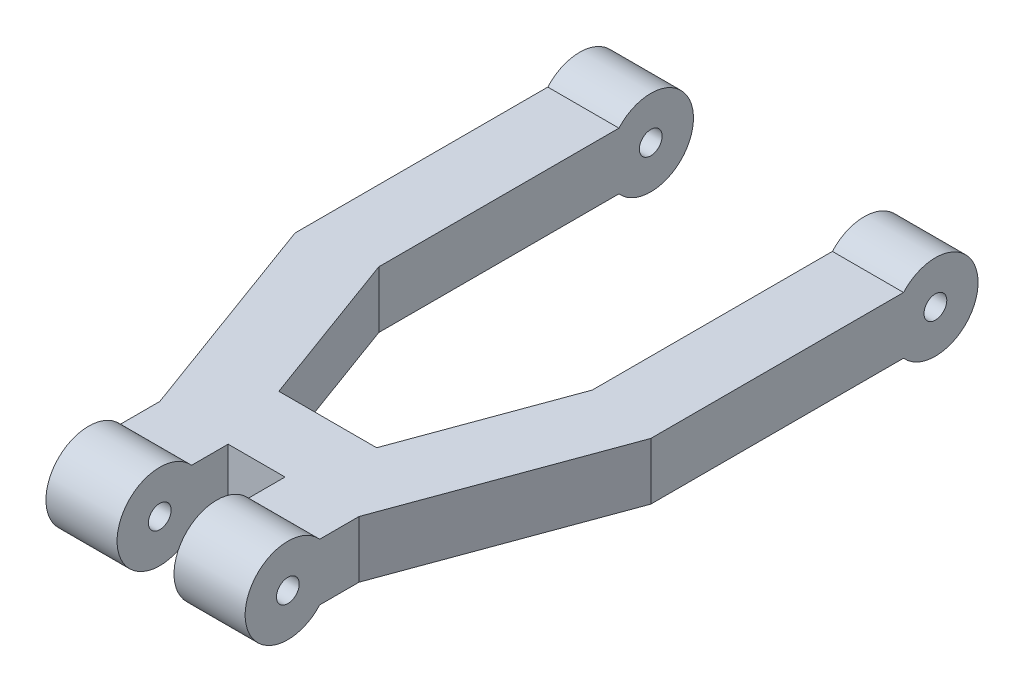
ISO-10303-21;
HEADER;
FILE_DESCRIPTION(('STEP AP214'),'2;1');
FILE_NAME('part.step','',(''),(''),'','','');
FILE_SCHEMA(('AUTOMOTIVE_DESIGN { 1 0 10303 214 1 1 1 1 }'));
ENDSEC;
DATA;
#1=APPLICATION_CONTEXT('core data for automotive mechanical design processes');
#2=APPLICATION_PROTOCOL_DEFINITION('international standard','automotive_design',2000,#1);
#3=PRODUCT_CONTEXT('',#1,'mechanical');
#4=PRODUCT('Part','Part','',(#3));
#5=PRODUCT_RELATED_PRODUCT_CATEGORY('part','',(#4));
#6=PRODUCT_DEFINITION_FORMATION('','',#4);
#7=PRODUCT_DEFINITION_CONTEXT('part definition',#1,'design');
#8=PRODUCT_DEFINITION('design','',#6,#7);
#9=PRODUCT_DEFINITION_SHAPE('','',#8);
#10=(LENGTH_UNIT() NAMED_UNIT(*) SI_UNIT(.MILLI.,.METRE.));
#11=(NAMED_UNIT(*) PLANE_ANGLE_UNIT() SI_UNIT($,.RADIAN.));
#12=(NAMED_UNIT(*) SI_UNIT($,.STERADIAN.) SOLID_ANGLE_UNIT());
#13=UNCERTAINTY_MEASURE_WITH_UNIT(LENGTH_MEASURE(1.E-05),#10,'distance_accuracy_value','');
#14=(GEOMETRIC_REPRESENTATION_CONTEXT(3) GLOBAL_UNCERTAINTY_ASSIGNED_CONTEXT((#13)) GLOBAL_UNIT_ASSIGNED_CONTEXT((#10,
#11,#12)) REPRESENTATION_CONTEXT('',''));
#15=CARTESIAN_POINT('',(0.,0.,0.));
#16=DIRECTION('',(0.,0.,1.));
#17=DIRECTION('',(1.,0.,0.));
#18=AXIS2_PLACEMENT_3D('',#15,#16,#17);
#19=CARTESIAN_POINT('',(0.,2.54,0.));
#20=DIRECTION('',(1.,0.,0.));
#21=DIRECTION('',(0.,0.,-1.));
#22=AXIS2_PLACEMENT_3D('',#19,#20,#21);
#23=CYLINDRICAL_SURFACE('',#22,3.81);
#24=CARTESIAN_POINT('',(13.335,2.54,0.));
#25=DIRECTION('',(-1.,0.,0.));
#26=DIRECTION('',(0.,0.,1.));
#27=AXIS2_PLACEMENT_3D('',#24,#25,#26);
#28=CIRCLE('',#27,3.81);
#29=CARTESIAN_POINT('',(13.335,5.08,-2.83980633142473));
#30=VERTEX_POINT('',#29);
#31=CARTESIAN_POINT('',(13.335,0.,-2.83980633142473));
#32=VERTEX_POINT('',#31);
#33=EDGE_CURVE('E273',#30,#32,#28,.F.);
#34=ORIENTED_EDGE('',*,*,#33,.F.);
#35=DIRECTION('',(1.,0.,0.));
#36=VECTOR('',#35,1.);
#37=CARTESIAN_POINT('',(0.,5.08,-2.83980633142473));
#38=LINE('',#37,#36);
#39=CARTESIAN_POINT('',(6.985,5.08,-2.83980633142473));
#40=VERTEX_POINT('',#39);
#41=EDGE_CURVE('E254',#40,#30,#38,.T.);
#42=ORIENTED_EDGE('',*,*,#41,.F.);
#43=CARTESIAN_POINT('',(6.985,2.54,0.));
#44=DIRECTION('',(1.,0.,0.));
#45=DIRECTION('',(0.,0.,-1.));
#46=AXIS2_PLACEMENT_3D('',#43,#44,#45);
#47=CIRCLE('',#46,3.81);
#48=CARTESIAN_POINT('',(6.985,0.,-2.83980633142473));
#49=VERTEX_POINT('',#48);
#50=EDGE_CURVE('E50',#49,#40,#47,.F.);
#51=ORIENTED_EDGE('',*,*,#50,.F.);
#52=DIRECTION('',(1.,0.,0.));
#53=VECTOR('',#52,1.);
#54=CARTESIAN_POINT('',(0.,0.,-2.83980633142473));
#55=LINE('',#54,#53);
#56=EDGE_CURVE('E255',#32,#49,#55,.F.);
#57=ORIENTED_EDGE('',*,*,#56,.F.);
#58=EDGE_LOOP('',(#34,#42,#51,#57));
#59=FACE_BOUND('',#58,.T.);
#60=ADVANCED_FACE('F33',(#59),#23,.T.);
#61=CARTESIAN_POINT('',(0.,2.54,-50.8));
#62=DIRECTION('',(1.,0.,0.));
#63=DIRECTION('',(0.,0.,-1.));
#64=AXIS2_PLACEMENT_3D('',#61,#62,#63);
#65=CYLINDRICAL_SURFACE('',#64,3.81);
#66=CARTESIAN_POINT('',(6.35,2.54,-50.8));
#67=DIRECTION('',(-1.,0.,0.));
#68=DIRECTION('',(0.,0.,1.));
#69=AXIS2_PLACEMENT_3D('',#66,#67,#68);
#70=CIRCLE('',#69,3.81);
#71=CARTESIAN_POINT('',(6.35,0.,-47.9601936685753));
#72=VERTEX_POINT('',#71);
#73=CARTESIAN_POINT('',(6.35,5.08,-47.9601936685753));
#74=VERTEX_POINT('',#73);
#75=EDGE_CURVE('E58',#72,#74,#70,.F.);
#76=ORIENTED_EDGE('',*,*,#75,.F.);
#77=DIRECTION('',(1.,0.,0.));
#78=VECTOR('',#77,1.);
#79=CARTESIAN_POINT('',(0.,0.,-47.9601936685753));
#80=LINE('',#79,#78);
#81=CARTESIAN_POINT('',(0.,0.,-47.9601936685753));
#82=VERTEX_POINT('',#81);
#83=EDGE_CURVE('E185',#82,#72,#80,.T.);
#84=ORIENTED_EDGE('',*,*,#83,.F.);
#85=CARTESIAN_POINT('',(0.,2.54,-50.8));
#86=DIRECTION('',(1.,0.,0.));
#87=DIRECTION('',(0.,0.,-1.));
#88=AXIS2_PLACEMENT_3D('',#85,#86,#87);
#89=CIRCLE('',#88,3.81);
#90=CARTESIAN_POINT('',(0.,5.08,-47.9601936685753));
#91=VERTEX_POINT('',#90);
#92=EDGE_CURVE('E241',#82,#91,#89,.T.);
#93=ORIENTED_EDGE('',*,*,#92,.T.);
#94=DIRECTION('',(1.,0.,0.));
#95=VECTOR('',#94,1.);
#96=CARTESIAN_POINT('',(0.,5.08,-47.9601936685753));
#97=LINE('',#96,#95);
#98=EDGE_CURVE('E244',#74,#91,#97,.F.);
#99=ORIENTED_EDGE('',*,*,#98,.F.);
#100=EDGE_LOOP('',(#76,#84,#93,#99));
#101=FACE_BOUND('',#100,.T.);
#102=ADVANCED_FACE('F372',(#101),#65,.T.);
#103=CARTESIAN_POINT('',(31.75,0.,0.));
#104=DIRECTION('',(0.,1.,0.));
#105=DIRECTION('',(0.,0.,1.));
#106=AXIS2_PLACEMENT_3D('',#103,#104,#105);
#107=PLANE('',#106);
#108=DIRECTION('',(-0.344254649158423,0.,0.938876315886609));
#109=VECTOR('',#108,1.);
#110=CARTESIAN_POINT('',(23.5404015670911,0.,-3.0101860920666));
#111=LINE('',#110,#109);
#112=CARTESIAN_POINT('',(31.75,0.,-25.4));
#113=VERTEX_POINT('',#112);
#114=CARTESIAN_POINT('',(24.765,0.,-6.35));
#115=VERTEX_POINT('',#114);
#116=EDGE_CURVE('E232',#113,#115,#111,.T.);
#117=ORIENTED_EDGE('',*,*,#116,.T.);
#118=DIRECTION('',(0.,0.,1.));
#119=VECTOR('',#118,1.);
#120=CARTESIAN_POINT('',(24.765,0.,0.));
#121=LINE('',#120,#119);
#122=CARTESIAN_POINT('',(24.765,0.,-2.83980633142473));
#123=VERTEX_POINT('',#122);
#124=EDGE_CURVE('E220',#115,#123,#121,.T.);
#125=ORIENTED_EDGE('',*,*,#124,.T.);
#126=CARTESIAN_POINT('',(18.415,0.,-2.83980633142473));
#127=VERTEX_POINT('',#126);
#128=EDGE_CURVE('E258',#123,#127,#55,.F.);
#129=ORIENTED_EDGE('',*,*,#128,.T.);
#130=DIRECTION('',(0.,0.,-1.));
#131=VECTOR('',#130,1.);
#132=CARTESIAN_POINT('',(18.415,0.,0.));
#133=LINE('',#132,#131);
#134=CARTESIAN_POINT('',(18.415,0.,-6.09943639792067));
#135=VERTEX_POINT('',#134);
#136=EDGE_CURVE('E211',#127,#135,#133,.T.);
#137=ORIENTED_EDGE('',*,*,#136,.T.);
#138=DIRECTION('',(-1.,0.,0.));
#139=VECTOR('',#138,1.);
#140=CARTESIAN_POINT('',(31.75,0.,-6.09943639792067));
#141=LINE('',#140,#139);
#142=CARTESIAN_POINT('',(13.335,0.,-6.09943639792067));
#143=VERTEX_POINT('',#142);
#144=EDGE_CURVE('E174',#135,#143,#141,.T.);
#145=ORIENTED_EDGE('',*,*,#144,.T.);
#146=DIRECTION('',(0.,0.,1.));
#147=VECTOR('',#146,1.);
#148=CARTESIAN_POINT('',(13.335,0.,0.));
#149=LINE('',#148,#147);
#150=EDGE_CURVE('E208',#143,#32,#149,.T.);
#151=ORIENTED_EDGE('',*,*,#150,.T.);
#152=ORIENTED_EDGE('',*,*,#56,.T.);
#153=DIRECTION('',(0.,0.,-1.));
#154=VECTOR('',#153,1.);
#155=CARTESIAN_POINT('',(6.985,0.,0.));
#156=LINE('',#155,#154);
#157=CARTESIAN_POINT('',(6.985,0.,-6.35));
#158=VERTEX_POINT('',#157);
#159=EDGE_CURVE('E199',#49,#158,#156,.T.);
#160=ORIENTED_EDGE('',*,*,#159,.T.);
#161=DIRECTION('',(-0.344254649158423,0.,-0.938876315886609));
#162=VECTOR('',#161,1.);
#163=CARTESIAN_POINT('',(11.9723310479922,0.,7.25181194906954));
#164=LINE('',#163,#162);
#165=CARTESIAN_POINT('',(0.,0.,-25.4));
#166=VERTEX_POINT('',#165);
#167=EDGE_CURVE('E226',#158,#166,#164,.T.);
#168=ORIENTED_EDGE('',*,*,#167,.T.);
#169=DIRECTION('',(0.,0.,-1.));
#170=VECTOR('',#169,1.);
#171=CARTESIAN_POINT('',(0.,0.,0.));
#172=LINE('',#171,#170);
#173=EDGE_CURVE('E265',#166,#82,#172,.T.);
#174=ORIENTED_EDGE('',*,*,#173,.T.);
#175=ORIENTED_EDGE('',*,*,#83,.T.);
#176=DIRECTION('',(0.,0.,1.));
#177=VECTOR('',#176,1.);
#178=CARTESIAN_POINT('',(6.35,0.,0.));
#179=LINE('',#178,#177);
#180=CARTESIAN_POINT('',(6.35,0.,-26.5274659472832));
#181=VERTEX_POINT('',#180);
#182=EDGE_CURVE('E178',#72,#181,#179,.T.);
#183=ORIENTED_EDGE('',*,*,#182,.T.);
#184=DIRECTION('',(0.344254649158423,0.,0.938876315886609));
#185=VECTOR('',#184,1.);
#186=CARTESIAN_POINT('',(17.9341956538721,0.,5.06579492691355));
#187=LINE('',#186,#185);
#188=CARTESIAN_POINT('',(11.5119441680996,0.,-12.4494363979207));
#189=VERTEX_POINT('',#188);
#190=EDGE_CURVE('E163',#181,#189,#187,.T.);
#191=ORIENTED_EDGE('',*,*,#190,.T.);
#192=DIRECTION('',(1.,0.,0.));
#193=VECTOR('',#192,1.);
#194=CARTESIAN_POINT('',(31.75,0.,-12.4494363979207));
#195=LINE('',#194,#193);
#196=CARTESIAN_POINT('',(20.2380558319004,0.,-12.4494363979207));
#197=VERTEX_POINT('',#196);
#198=EDGE_CURVE('E173',#189,#197,#195,.T.);
#199=ORIENTED_EDGE('',*,*,#198,.T.);
#200=DIRECTION('',(0.344254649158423,0.,-0.938876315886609));
#201=VECTOR('',#200,1.);
#202=CARTESIAN_POINT('',(17.5785369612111,0.,-5.19620311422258));
#203=LINE('',#202,#201);
#204=CARTESIAN_POINT('',(25.4,0.,-26.5274659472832));
#205=VERTEX_POINT('',#204);
#206=EDGE_CURVE('E237',#197,#205,#203,.T.);
#207=ORIENTED_EDGE('',*,*,#206,.T.);
#208=DIRECTION('',(0.,0.,-1.));
#209=VECTOR('',#208,1.);
#210=CARTESIAN_POINT('',(25.4,0.,0.));
#211=LINE('',#210,#209);
#212=CARTESIAN_POINT('',(25.4,0.,-47.9601936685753));
#213=VERTEX_POINT('',#212);
#214=EDGE_CURVE('E196',#205,#213,#211,.T.);
#215=ORIENTED_EDGE('',*,*,#214,.T.);
#216=CARTESIAN_POINT('',(31.75,0.,-47.9601936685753));
#217=VERTEX_POINT('',#216);
#218=EDGE_CURVE('E249',#213,#217,#80,.T.);
#219=ORIENTED_EDGE('',*,*,#218,.T.);
#220=DIRECTION('',(0.,0.,-1.));
#221=VECTOR('',#220,1.);
#222=CARTESIAN_POINT('',(31.75,0.,0.));
#223=LINE('',#222,#221);
#224=EDGE_CURVE('E259',#113,#217,#223,.T.);
#225=ORIENTED_EDGE('',*,*,#224,.F.);
#226=EDGE_LOOP('',(#117,#125,#129,#137,#145,#151,#152,#160,#168,#174,#175,#183,#191,#199,#207,
#215,#219,#225));
#227=FACE_BOUND('',#226,.T.);
#228=ADVANCED_FACE('F35',(#227),#107,.F.);
#229=CARTESIAN_POINT('',(31.75,5.08,0.));
#230=DIRECTION('',(0.,-1.,0.));
#231=DIRECTION('',(0.,0.,-1.));
#232=AXIS2_PLACEMENT_3D('',#229,#230,#231);
#233=PLANE('',#232);
#234=CARTESIAN_POINT('',(18.415,5.08,-2.83980633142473));
#235=VERTEX_POINT('',#234);
#236=CARTESIAN_POINT('',(24.765,5.08,-2.83980633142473));
#237=VERTEX_POINT('',#236);
#238=EDGE_CURVE('E251',#235,#237,#38,.T.);
#239=ORIENTED_EDGE('',*,*,#238,.T.);
#240=DIRECTION('',(0.,0.,-1.));
#241=VECTOR('',#240,1.);
#242=CARTESIAN_POINT('',(24.765,5.08,0.));
#243=LINE('',#242,#241);
#244=CARTESIAN_POINT('',(24.765,5.08,-6.35));
#245=VERTEX_POINT('',#244);
#246=EDGE_CURVE('E217',#237,#245,#243,.T.);
#247=ORIENTED_EDGE('',*,*,#246,.T.);
#248=DIRECTION('',(0.344254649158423,0.,-0.938876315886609));
#249=VECTOR('',#248,1.);
#250=CARTESIAN_POINT('',(23.5404015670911,5.08,-3.0101860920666));
#251=LINE('',#250,#249);
#252=CARTESIAN_POINT('',(31.75,5.08,-25.4));
#253=VERTEX_POINT('',#252);
#254=EDGE_CURVE('E229',#245,#253,#251,.T.);
#255=ORIENTED_EDGE('',*,*,#254,.T.);
#256=DIRECTION('',(0.,0.,1.));
#257=VECTOR('',#256,1.);
#258=CARTESIAN_POINT('',(31.75,5.08,0.));
#259=LINE('',#258,#257);
#260=CARTESIAN_POINT('',(31.75,5.08,-47.9601936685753));
#261=VERTEX_POINT('',#260);
#262=EDGE_CURVE('E261',#261,#253,#259,.T.);
#263=ORIENTED_EDGE('',*,*,#262,.F.);
#264=CARTESIAN_POINT('',(25.4,5.08,-47.9601936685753));
#265=VERTEX_POINT('',#264);
#266=EDGE_CURVE('E246',#261,#265,#97,.F.);
#267=ORIENTED_EDGE('',*,*,#266,.T.);
#268=DIRECTION('',(0.,0.,1.));
#269=VECTOR('',#268,1.);
#270=CARTESIAN_POINT('',(25.4,5.08,0.));
#271=LINE('',#270,#269);
#272=CARTESIAN_POINT('',(25.4,5.08,-26.5274659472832));
#273=VERTEX_POINT('',#272);
#274=EDGE_CURVE('E188',#265,#273,#271,.T.);
#275=ORIENTED_EDGE('',*,*,#274,.T.);
#276=DIRECTION('',(-0.344254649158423,0.,0.938876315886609));
#277=VECTOR('',#276,1.);
#278=CARTESIAN_POINT('',(17.5785369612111,5.08,-5.19620311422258));
#279=LINE('',#278,#277);
#280=CARTESIAN_POINT('',(20.2380558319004,5.08,-12.4494363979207));
#281=VERTEX_POINT('',#280);
#282=EDGE_CURVE('E11',#273,#281,#279,.T.);
#283=ORIENTED_EDGE('',*,*,#282,.T.);
#284=DIRECTION('',(-1.,0.,0.));
#285=VECTOR('',#284,1.);
#286=CARTESIAN_POINT('',(31.75,5.08,-12.4494363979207));
#287=LINE('',#286,#285);
#288=CARTESIAN_POINT('',(11.5119441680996,5.08,-12.4494363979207));
#289=VERTEX_POINT('',#288);
#290=EDGE_CURVE('E42',#281,#289,#287,.T.);
#291=ORIENTED_EDGE('',*,*,#290,.T.);
#292=DIRECTION('',(-0.344254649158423,0.,-0.938876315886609));
#293=VECTOR('',#292,1.);
#294=CARTESIAN_POINT('',(17.9341956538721,5.08,5.06579492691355));
#295=LINE('',#294,#293);
#296=CARTESIAN_POINT('',(6.35,5.08,-26.5274659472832));
#297=VERTEX_POINT('',#296);
#298=EDGE_CURVE('E287',#289,#297,#295,.T.);
#299=ORIENTED_EDGE('',*,*,#298,.T.);
#300=DIRECTION('',(0.,0.,-1.));
#301=VECTOR('',#300,1.);
#302=CARTESIAN_POINT('',(6.35,5.08,0.));
#303=LINE('',#302,#301);
#304=EDGE_CURVE('E181',#297,#74,#303,.T.);
#305=ORIENTED_EDGE('',*,*,#304,.T.);
#306=ORIENTED_EDGE('',*,*,#98,.T.);
#307=DIRECTION('',(0.,0.,1.));
#308=VECTOR('',#307,1.);
#309=CARTESIAN_POINT('',(0.,5.08,0.));
#310=LINE('',#309,#308);
#311=CARTESIAN_POINT('',(0.,5.08,-25.4));
#312=VERTEX_POINT('',#311);
#313=EDGE_CURVE('E262',#91,#312,#310,.T.);
#314=ORIENTED_EDGE('',*,*,#313,.T.);
#315=DIRECTION('',(0.344254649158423,0.,0.938876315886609));
#316=VECTOR('',#315,1.);
#317=CARTESIAN_POINT('',(11.9723310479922,5.08,7.25181194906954));
#318=LINE('',#317,#316);
#319=CARTESIAN_POINT('',(6.985,5.08,-6.35));
#320=VERTEX_POINT('',#319);
#321=EDGE_CURVE('E223',#312,#320,#318,.T.);
#322=ORIENTED_EDGE('',*,*,#321,.T.);
#323=DIRECTION('',(0.,0.,1.));
#324=VECTOR('',#323,1.);
#325=CARTESIAN_POINT('',(6.985,5.08,0.));
#326=LINE('',#325,#324);
#327=EDGE_CURVE('E202',#320,#40,#326,.T.);
#328=ORIENTED_EDGE('',*,*,#327,.T.);
#329=ORIENTED_EDGE('',*,*,#41,.T.);
#330=DIRECTION('',(0.,0.,-1.));
#331=VECTOR('',#330,1.);
#332=CARTESIAN_POINT('',(13.335,5.08,0.));
#333=LINE('',#332,#331);
#334=CARTESIAN_POINT('',(13.335,5.08,-6.09943639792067));
#335=VERTEX_POINT('',#334);
#336=EDGE_CURVE('E205',#30,#335,#333,.T.);
#337=ORIENTED_EDGE('',*,*,#336,.T.);
#338=DIRECTION('',(1.,0.,0.));
#339=VECTOR('',#338,1.);
#340=CARTESIAN_POINT('',(31.75,5.08,-6.09943639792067));
#341=LINE('',#340,#339);
#342=CARTESIAN_POINT('',(18.415,5.08,-6.09943639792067));
#343=VERTEX_POINT('',#342);
#344=EDGE_CURVE('E284',#335,#343,#341,.T.);
#345=ORIENTED_EDGE('',*,*,#344,.T.);
#346=DIRECTION('',(0.,0.,1.));
#347=VECTOR('',#346,1.);
#348=CARTESIAN_POINT('',(18.415,5.08,0.));
#349=LINE('',#348,#347);
#350=EDGE_CURVE('E214',#343,#235,#349,.T.);
#351=ORIENTED_EDGE('',*,*,#350,.T.);
#352=EDGE_LOOP('',(#239,#247,#255,#263,#267,#275,#283,#291,#299,#305,#306,#314,#322,#328,#329,
#337,#345,#351));
#353=FACE_BOUND('',#352,.T.);
#354=ADVANCED_FACE('F332',(#353),#233,.F.);
#355=CARTESIAN_POINT('',(31.75,0.,0.));
#356=DIRECTION('',(-1.,0.,0.));
#357=DIRECTION('',(0.,0.,1.));
#358=AXIS2_PLACEMENT_3D('',#355,#356,#357);
#359=PLANE('',#358);
#360=CARTESIAN_POINT('',(31.75,2.54,-50.8));
#361=DIRECTION('',(-1.,0.,0.));
#362=DIRECTION('',(0.,0.,1.));
#363=AXIS2_PLACEMENT_3D('',#360,#361,#362);
#364=CIRCLE('',#363,1.016);
#365=CARTESIAN_POINT('',(31.75,2.54,-49.784));
#366=VERTEX_POINT('',#365);
#367=EDGE_CURVE('E293',#366,#366,#364,.T.);
#368=ORIENTED_EDGE('',*,*,#367,.T.);
#369=EDGE_LOOP('',(#368));
#370=FACE_BOUND('',#369,.T.);
#371=ORIENTED_EDGE('',*,*,#262,.T.);
#372=DIRECTION('',(0.,-1.,0.));
#373=VECTOR('',#372,1.);
#374=CARTESIAN_POINT('',(31.75,0.,-25.4));
#375=LINE('',#374,#373);
#376=EDGE_CURVE('E281',#253,#113,#375,.T.);
#377=ORIENTED_EDGE('',*,*,#376,.T.);
#378=ORIENTED_EDGE('',*,*,#224,.T.);
#379=CARTESIAN_POINT('',(31.75,2.54,-50.8));
#380=DIRECTION('',(1.,0.,0.));
#381=DIRECTION('',(0.,0.,-1.));
#382=AXIS2_PLACEMENT_3D('',#379,#380,#381);
#383=CIRCLE('',#382,3.81);
#384=EDGE_CURVE('E240',#217,#261,#383,.T.);
#385=ORIENTED_EDGE('',*,*,#384,.T.);
#386=EDGE_LOOP('',(#371,#377,#378,#385));
#387=FACE_BOUND('',#386,.T.);
#388=ADVANCED_FACE('F348',(#370,#387),#359,.F.);
#389=CARTESIAN_POINT('',(0.,0.,0.));
#390=DIRECTION('',(-1.,0.,0.));
#391=DIRECTION('',(0.,0.,1.));
#392=AXIS2_PLACEMENT_3D('',#389,#390,#391);
#393=PLANE('',#392);
#394=CARTESIAN_POINT('',(0.,2.54,-50.8));
#395=DIRECTION('',(-1.,0.,0.));
#396=DIRECTION('',(0.,0.,1.));
#397=AXIS2_PLACEMENT_3D('',#394,#395,#396);
#398=CIRCLE('',#397,1.016);
#399=CARTESIAN_POINT('',(0.,2.54,-49.784));
#400=VERTEX_POINT('',#399);
#401=EDGE_CURVE('E300',#400,#400,#398,.T.);
#402=ORIENTED_EDGE('',*,*,#401,.F.);
#403=EDGE_LOOP('',(#402));
#404=FACE_BOUND('',#403,.T.);
#405=DIRECTION('',(0.,-1.,0.));
#406=VECTOR('',#405,1.);
#407=CARTESIAN_POINT('',(0.,0.,-25.4));
#408=LINE('',#407,#406);
#409=EDGE_CURVE('E279',#312,#166,#408,.T.);
#410=ORIENTED_EDGE('',*,*,#409,.F.);
#411=ORIENTED_EDGE('',*,*,#313,.F.);
#412=ORIENTED_EDGE('',*,*,#92,.F.);
#413=ORIENTED_EDGE('',*,*,#173,.F.);
#414=EDGE_LOOP('',(#410,#411,#412,#413));
#415=FACE_BOUND('',#414,.T.);
#416=ADVANCED_FACE('F380',(#404,#415),#393,.T.);
#417=CARTESIAN_POINT('',(24.765,2.54,0.));
#418=DIRECTION('',(-1.,0.,0.));
#419=DIRECTION('',(0.,0.,1.));
#420=AXIS2_PLACEMENT_3D('',#417,#418,#419);
#421=CIRCLE('',#420,3.81);
#422=EDGE_CURVE('E277',#237,#123,#421,.F.);
#423=ORIENTED_EDGE('',*,*,#422,.F.);
#424=ORIENTED_EDGE('',*,*,#238,.F.);
#425=CARTESIAN_POINT('',(18.415,2.54,0.));
#426=DIRECTION('',(1.,0.,0.));
#427=DIRECTION('',(0.,0.,-1.));
#428=AXIS2_PLACEMENT_3D('',#425,#426,#427);
#429=CIRCLE('',#428,3.81);
#430=EDGE_CURVE('E275',#127,#235,#429,.F.);
#431=ORIENTED_EDGE('',*,*,#430,.F.);
#432=ORIENTED_EDGE('',*,*,#128,.F.);
#433=EDGE_LOOP('',(#423,#424,#431,#432));
#434=FACE_BOUND('',#433,.T.);
#435=ADVANCED_FACE('F359',(#434),#23,.T.);
#436=CARTESIAN_POINT('',(25.4,2.54,-50.8));
#437=DIRECTION('',(1.,0.,0.));
#438=DIRECTION('',(0.,0.,-1.));
#439=AXIS2_PLACEMENT_3D('',#436,#437,#438);
#440=CIRCLE('',#439,3.81);
#441=EDGE_CURVE('E270',#265,#213,#440,.F.);
#442=ORIENTED_EDGE('',*,*,#441,.F.);
#443=ORIENTED_EDGE('',*,*,#266,.F.);
#444=ORIENTED_EDGE('',*,*,#384,.F.);
#445=ORIENTED_EDGE('',*,*,#218,.F.);
#446=EDGE_LOOP('',(#442,#443,#444,#445));
#447=FACE_BOUND('',#446,.T.);
#448=ADVANCED_FACE('F344',(#447),#65,.T.);
#449=CARTESIAN_POINT('',(25.4,-1.27,-26.5274659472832));
#450=DIRECTION('',(0.938876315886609,0.,0.344254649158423));
#451=DIRECTION('',(0.344254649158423,0.,-0.938876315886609));
#452=AXIS2_PLACEMENT_3D('',#449,#450,#451);
#453=PLANE('',#452);
#454=DIRECTION('',(0.,1.,0.));
#455=VECTOR('',#454,1.);
#456=CARTESIAN_POINT('',(20.2380558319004,-1.27,-12.4494363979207));
#457=LINE('',#456,#455);
#458=EDGE_CURVE('E325',#197,#281,#457,.T.);
#459=ORIENTED_EDGE('',*,*,#458,.T.);
#460=ORIENTED_EDGE('',*,*,#282,.F.);
#461=DIRECTION('',(0.,1.,0.));
#462=VECTOR('',#461,1.);
#463=CARTESIAN_POINT('',(25.4,-1.27,-26.5274659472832));
#464=LINE('',#463,#462);
#465=EDGE_CURVE('E191',#205,#273,#464,.T.);
#466=ORIENTED_EDGE('',*,*,#465,.F.);
#467=ORIENTED_EDGE('',*,*,#206,.F.);
#468=EDGE_LOOP('',(#459,#460,#466,#467));
#469=FACE_BOUND('',#468,.T.);
#470=ADVANCED_FACE('F336',(#469),#453,.F.);
#471=CARTESIAN_POINT('',(11.5119441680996,-1.27,-12.4494363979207));
#472=DIRECTION('',(0.,0.,1.));
#473=DIRECTION('',(1.,0.,0.));
#474=AXIS2_PLACEMENT_3D('',#471,#472,#473);
#475=PLANE('',#474);
#476=DIRECTION('',(0.,1.,0.));
#477=VECTOR('',#476,1.);
#478=CARTESIAN_POINT('',(11.5119441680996,-1.27,-12.4494363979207));
#479=LINE('',#478,#477);
#480=EDGE_CURVE('E169',#189,#289,#479,.T.);
#481=ORIENTED_EDGE('',*,*,#480,.T.);
#482=ORIENTED_EDGE('',*,*,#290,.F.);
#483=ORIENTED_EDGE('',*,*,#458,.F.);
#484=ORIENTED_EDGE('',*,*,#198,.F.);
#485=EDGE_LOOP('',(#481,#482,#483,#484));
#486=FACE_BOUND('',#485,.T.);
#487=ADVANCED_FACE('F329',(#486),#475,.F.);
#488=CARTESIAN_POINT('',(6.35,-1.27,-26.5274659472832));
#489=DIRECTION('',(-0.938876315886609,0.,0.344254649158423));
#490=DIRECTION('',(0.344254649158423,0.,0.938876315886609));
#491=AXIS2_PLACEMENT_3D('',#488,#489,#490);
#492=PLANE('',#491);
#493=DIRECTION('',(0.,1.,0.));
#494=VECTOR('',#493,1.);
#495=CARTESIAN_POINT('',(6.35,-1.27,-26.5274659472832));
#496=LINE('',#495,#494);
#497=EDGE_CURVE('E166',#181,#297,#496,.T.);
#498=ORIENTED_EDGE('',*,*,#497,.T.);
#499=ORIENTED_EDGE('',*,*,#298,.F.);
#500=ORIENTED_EDGE('',*,*,#480,.F.);
#501=ORIENTED_EDGE('',*,*,#190,.F.);
#502=EDGE_LOOP('',(#498,#499,#500,#501));
#503=FACE_BOUND('',#502,.T.);
#504=ADVANCED_FACE('F165',(#503),#492,.F.);
#505=CARTESIAN_POINT('',(25.4,-1.27,-57.9100704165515));
#506=DIRECTION('',(1.,0.,0.));
#507=DIRECTION('',(0.,0.,-1.));
#508=AXIS2_PLACEMENT_3D('',#505,#506,#507);
#509=PLANE('',#508);
#510=CARTESIAN_POINT('',(25.4,2.54,-50.8));
#511=DIRECTION('',(1.,0.,0.));
#512=DIRECTION('',(0.,0.,-1.));
#513=AXIS2_PLACEMENT_3D('',#510,#511,#512);
#514=CIRCLE('',#513,1.016);
#515=CARTESIAN_POINT('',(25.4,2.54,-51.816));
#516=VERTEX_POINT('',#515);
#517=EDGE_CURVE('E312',#516,#516,#514,.T.);
#518=ORIENTED_EDGE('',*,*,#517,.T.);
#519=EDGE_LOOP('',(#518));
#520=FACE_BOUND('',#519,.T.);
#521=ORIENTED_EDGE('',*,*,#465,.T.);
#522=ORIENTED_EDGE('',*,*,#274,.F.);
#523=ORIENTED_EDGE('',*,*,#441,.T.);
#524=ORIENTED_EDGE('',*,*,#214,.F.);
#525=EDGE_LOOP('',(#521,#522,#523,#524));
#526=FACE_BOUND('',#525,.T.);
#527=ADVANCED_FACE('F338',(#520,#526),#509,.F.);
#528=CARTESIAN_POINT('',(6.35,-1.27,-57.9100704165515));
#529=DIRECTION('',(-1.,0.,0.));
#530=DIRECTION('',(0.,0.,1.));
#531=AXIS2_PLACEMENT_3D('',#528,#529,#530);
#532=PLANE('',#531);
#533=CARTESIAN_POINT('',(6.35,2.54,-50.8));
#534=DIRECTION('',(-1.,0.,0.));
#535=DIRECTION('',(0.,0.,1.));
#536=AXIS2_PLACEMENT_3D('',#533,#534,#535);
#537=CIRCLE('',#536,1.016);
#538=CARTESIAN_POINT('',(6.35,2.54,-49.784));
#539=VERTEX_POINT('',#538);
#540=EDGE_CURVE('E37',#539,#539,#537,.T.);
#541=ORIENTED_EDGE('',*,*,#540,.T.);
#542=EDGE_LOOP('',(#541));
#543=FACE_BOUND('',#542,.T.);
#544=ORIENTED_EDGE('',*,*,#497,.F.);
#545=ORIENTED_EDGE('',*,*,#182,.F.);
#546=ORIENTED_EDGE('',*,*,#75,.T.);
#547=ORIENTED_EDGE('',*,*,#304,.F.);
#548=EDGE_LOOP('',(#544,#545,#546,#547));
#549=FACE_BOUND('',#548,.T.);
#550=ADVANCED_FACE('F177',(#543,#549),#532,.F.);
#551=CARTESIAN_POINT('',(0.,-1.27,-25.4));
#552=DIRECTION('',(0.938876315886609,0.,-0.344254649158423));
#553=DIRECTION('',(-0.344254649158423,0.,-0.938876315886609));
#554=AXIS2_PLACEMENT_3D('',#551,#552,#553);
#555=PLANE('',#554);
#556=DIRECTION('',(0.,1.,0.));
#557=VECTOR('',#556,1.);
#558=CARTESIAN_POINT('',(6.985,-1.27,-6.35));
#559=LINE('',#558,#557);
#560=EDGE_CURVE('E186',#158,#320,#559,.T.);
#561=ORIENTED_EDGE('',*,*,#560,.T.);
#562=ORIENTED_EDGE('',*,*,#321,.F.);
#563=ORIENTED_EDGE('',*,*,#409,.T.);
#564=ORIENTED_EDGE('',*,*,#167,.F.);
#565=EDGE_LOOP('',(#561,#562,#563,#564));
#566=FACE_BOUND('',#565,.T.);
#567=ADVANCED_FACE('F448',(#566),#555,.F.);
#568=CARTESIAN_POINT('',(6.985,-1.27,-6.35));
#569=DIRECTION('',(1.,0.,0.));
#570=DIRECTION('',(0.,0.,-1.));
#571=AXIS2_PLACEMENT_3D('',#568,#569,#570);
#572=PLANE('',#571);
#573=CARTESIAN_POINT('',(6.985,2.54,0.));
#574=DIRECTION('',(1.,0.,0.));
#575=DIRECTION('',(0.,0.,-1.));
#576=AXIS2_PLACEMENT_3D('',#573,#574,#575);
#577=CIRCLE('',#576,1.016);
#578=CARTESIAN_POINT('',(6.985,2.54,-1.016));
#579=VERTEX_POINT('',#578);
#580=EDGE_CURVE('E309',#579,#579,#577,.T.);
#581=ORIENTED_EDGE('',*,*,#580,.T.);
#582=EDGE_LOOP('',(#581));
#583=FACE_BOUND('',#582,.T.);
#584=ORIENTED_EDGE('',*,*,#560,.F.);
#585=ORIENTED_EDGE('',*,*,#159,.F.);
#586=ORIENTED_EDGE('',*,*,#50,.T.);
#587=ORIENTED_EDGE('',*,*,#327,.F.);
#588=EDGE_LOOP('',(#584,#585,#586,#587));
#589=FACE_BOUND('',#588,.T.);
#590=ADVANCED_FACE('F457',(#583,#589),#572,.F.);
#591=CARTESIAN_POINT('',(13.335,-1.27,-6.09943639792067));
#592=DIRECTION('',(0.,0.,-1.));
#593=DIRECTION('',(-1.,0.,0.));
#594=AXIS2_PLACEMENT_3D('',#591,#592,#593);
#595=PLANE('',#594);
#596=DIRECTION('',(0.,1.,0.));
#597=VECTOR('',#596,1.);
#598=CARTESIAN_POINT('',(18.415,-1.27,-6.09943639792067));
#599=LINE('',#598,#597);
#600=EDGE_CURVE('E315',#135,#343,#599,.T.);
#601=ORIENTED_EDGE('',*,*,#600,.T.);
#602=ORIENTED_EDGE('',*,*,#344,.F.);
#603=DIRECTION('',(0.,1.,0.));
#604=VECTOR('',#603,1.);
#605=CARTESIAN_POINT('',(13.335,-1.27,-6.09943639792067));
#606=LINE('',#605,#604);
#607=EDGE_CURVE('E316',#143,#335,#606,.T.);
#608=ORIENTED_EDGE('',*,*,#607,.F.);
#609=ORIENTED_EDGE('',*,*,#144,.F.);
#610=EDGE_LOOP('',(#601,#602,#608,#609));
#611=FACE_BOUND('',#610,.T.);
#612=ADVANCED_FACE('F365',(#611),#595,.F.);
#613=CARTESIAN_POINT('',(18.415,-1.27,-6.09943639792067));
#614=DIRECTION('',(1.,0.,0.));
#615=DIRECTION('',(0.,0.,-1.));
#616=AXIS2_PLACEMENT_3D('',#613,#614,#615);
#617=PLANE('',#616);
#618=CARTESIAN_POINT('',(18.415,2.54,0.));
#619=DIRECTION('',(1.,0.,0.));
#620=DIRECTION('',(0.,0.,-1.));
#621=AXIS2_PLACEMENT_3D('',#618,#619,#620);
#622=CIRCLE('',#621,1.016);
#623=CARTESIAN_POINT('',(18.415,2.54,-1.016));
#624=VERTEX_POINT('',#623);
#625=EDGE_CURVE('E297',#624,#624,#622,.T.);
#626=ORIENTED_EDGE('',*,*,#625,.T.);
#627=EDGE_LOOP('',(#626));
#628=FACE_BOUND('',#627,.T.);
#629=ORIENTED_EDGE('',*,*,#600,.F.);
#630=ORIENTED_EDGE('',*,*,#136,.F.);
#631=ORIENTED_EDGE('',*,*,#430,.T.);
#632=ORIENTED_EDGE('',*,*,#350,.F.);
#633=EDGE_LOOP('',(#629,#630,#631,#632));
#634=FACE_BOUND('',#633,.T.);
#635=ADVANCED_FACE('F363',(#628,#634),#617,.F.);
#636=CARTESIAN_POINT('',(13.335,-1.27,-6.09943639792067));
#637=DIRECTION('',(-1.,0.,0.));
#638=DIRECTION('',(0.,0.,1.));
#639=AXIS2_PLACEMENT_3D('',#636,#637,#638);
#640=PLANE('',#639);
#641=CARTESIAN_POINT('',(13.335,2.54,0.));
#642=DIRECTION('',(-1.,0.,0.));
#643=DIRECTION('',(0.,0.,1.));
#644=AXIS2_PLACEMENT_3D('',#641,#642,#643);
#645=CIRCLE('',#644,1.016);
#646=CARTESIAN_POINT('',(13.335,2.54,1.016));
#647=VERTEX_POINT('',#646);
#648=EDGE_CURVE('E292',#647,#647,#645,.T.);
#649=ORIENTED_EDGE('',*,*,#648,.T.);
#650=EDGE_LOOP('',(#649));
#651=FACE_BOUND('',#650,.T.);
#652=ORIENTED_EDGE('',*,*,#607,.T.);
#653=ORIENTED_EDGE('',*,*,#336,.F.);
#654=ORIENTED_EDGE('',*,*,#33,.T.);
#655=ORIENTED_EDGE('',*,*,#150,.F.);
#656=EDGE_LOOP('',(#652,#653,#654,#655));
#657=FACE_BOUND('',#656,.T.);
#658=ADVANCED_FACE('F370',(#651,#657),#640,.F.);
#659=CARTESIAN_POINT('',(31.75,-1.27,-25.4));
#660=DIRECTION('',(-0.938876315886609,0.,-0.344254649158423));
#661=DIRECTION('',(-0.344254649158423,0.,0.938876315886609));
#662=AXIS2_PLACEMENT_3D('',#659,#660,#661);
#663=PLANE('',#662);
#664=ORIENTED_EDGE('',*,*,#376,.F.);
#665=ORIENTED_EDGE('',*,*,#254,.F.);
#666=DIRECTION('',(0.,1.,0.));
#667=VECTOR('',#666,1.);
#668=CARTESIAN_POINT('',(24.765,-1.27,-6.35));
#669=LINE('',#668,#667);
#670=EDGE_CURVE('E182',#115,#245,#669,.T.);
#671=ORIENTED_EDGE('',*,*,#670,.F.);
#672=ORIENTED_EDGE('',*,*,#116,.F.);
#673=EDGE_LOOP('',(#664,#665,#671,#672));
#674=FACE_BOUND('',#673,.T.);
#675=ADVANCED_FACE('F353',(#674),#663,.F.);
#676=CARTESIAN_POINT('',(24.765,-1.27,-6.35));
#677=DIRECTION('',(-1.,0.,0.));
#678=DIRECTION('',(0.,0.,1.));
#679=AXIS2_PLACEMENT_3D('',#676,#677,#678);
#680=PLANE('',#679);
#681=CARTESIAN_POINT('',(24.765,2.54,0.));
#682=DIRECTION('',(-1.,0.,0.));
#683=DIRECTION('',(0.,0.,1.));
#684=AXIS2_PLACEMENT_3D('',#681,#682,#683);
#685=CIRCLE('',#684,1.016);
#686=CARTESIAN_POINT('',(24.765,2.54,1.016));
#687=VERTEX_POINT('',#686);
#688=EDGE_CURVE('E290',#687,#687,#685,.T.);
#689=ORIENTED_EDGE('',*,*,#688,.T.);
#690=EDGE_LOOP('',(#689));
#691=FACE_BOUND('',#690,.T.);
#692=ORIENTED_EDGE('',*,*,#670,.T.);
#693=ORIENTED_EDGE('',*,*,#246,.F.);
#694=ORIENTED_EDGE('',*,*,#422,.T.);
#695=ORIENTED_EDGE('',*,*,#124,.F.);
#696=EDGE_LOOP('',(#692,#693,#694,#695));
#697=FACE_BOUND('',#696,.T.);
#698=ADVANCED_FACE('F356',(#691,#697),#680,.F.);
#699=CARTESIAN_POINT('',(31.75,2.54,0.));
#700=DIRECTION('',(-1.,0.,0.));
#701=DIRECTION('',(0.,0.,1.));
#702=AXIS2_PLACEMENT_3D('',#699,#700,#701);
#703=CYLINDRICAL_SURFACE('',#702,1.016);
#704=ORIENTED_EDGE('',*,*,#688,.F.);
#705=EDGE_LOOP('',(#704));
#706=FACE_BOUND('',#705,.T.);
#707=ORIENTED_EDGE('',*,*,#625,.F.);
#708=EDGE_LOOP('',(#707));
#709=FACE_BOUND('',#708,.T.);
#710=ADVANCED_FACE('F504',(#706,#709),#703,.F.);
#711=ORIENTED_EDGE('',*,*,#648,.F.);
#712=EDGE_LOOP('',(#711));
#713=FACE_BOUND('',#712,.T.);
#714=ORIENTED_EDGE('',*,*,#580,.F.);
#715=EDGE_LOOP('',(#714));
#716=FACE_BOUND('',#715,.T.);
#717=ADVANCED_FACE('F512',(#713,#716),#703,.F.);
#718=CARTESIAN_POINT('',(31.75,2.54,-50.8));
#719=DIRECTION('',(-1.,0.,0.));
#720=DIRECTION('',(0.,0.,1.));
#721=AXIS2_PLACEMENT_3D('',#718,#719,#720);
#722=CYLINDRICAL_SURFACE('',#721,1.016);
#723=ORIENTED_EDGE('',*,*,#401,.T.);
#724=EDGE_LOOP('',(#723));
#725=FACE_BOUND('',#724,.T.);
#726=ORIENTED_EDGE('',*,*,#540,.F.);
#727=EDGE_LOOP('',(#726));
#728=FACE_BOUND('',#727,.T.);
#729=ADVANCED_FACE('F521',(#725,#728),#722,.F.);
#730=ORIENTED_EDGE('',*,*,#367,.F.);
#731=EDGE_LOOP('',(#730));
#732=FACE_BOUND('',#731,.T.);
#733=ORIENTED_EDGE('',*,*,#517,.F.);
#734=EDGE_LOOP('',(#733));
#735=FACE_BOUND('',#734,.T.);
#736=ADVANCED_FACE('F529',(#732,#735),#722,.F.);
#737=CLOSED_SHELL('',(#60,#102,#228,#354,#388,#416,#435,#448,#470,#487,#504,#527,#550,#567,#590,
#612,#635,#658,#675,#698,#710,#717,#729,#736));
#738=MANIFOLD_SOLID_BREP('B2',#737);
#739=ADVANCED_BREP_SHAPE_REPRESENTATION('',(#18,#738),#14);
#740=SHAPE_DEFINITION_REPRESENTATION(#9,#739);
ENDSEC;
END-ISO-10303-21;
